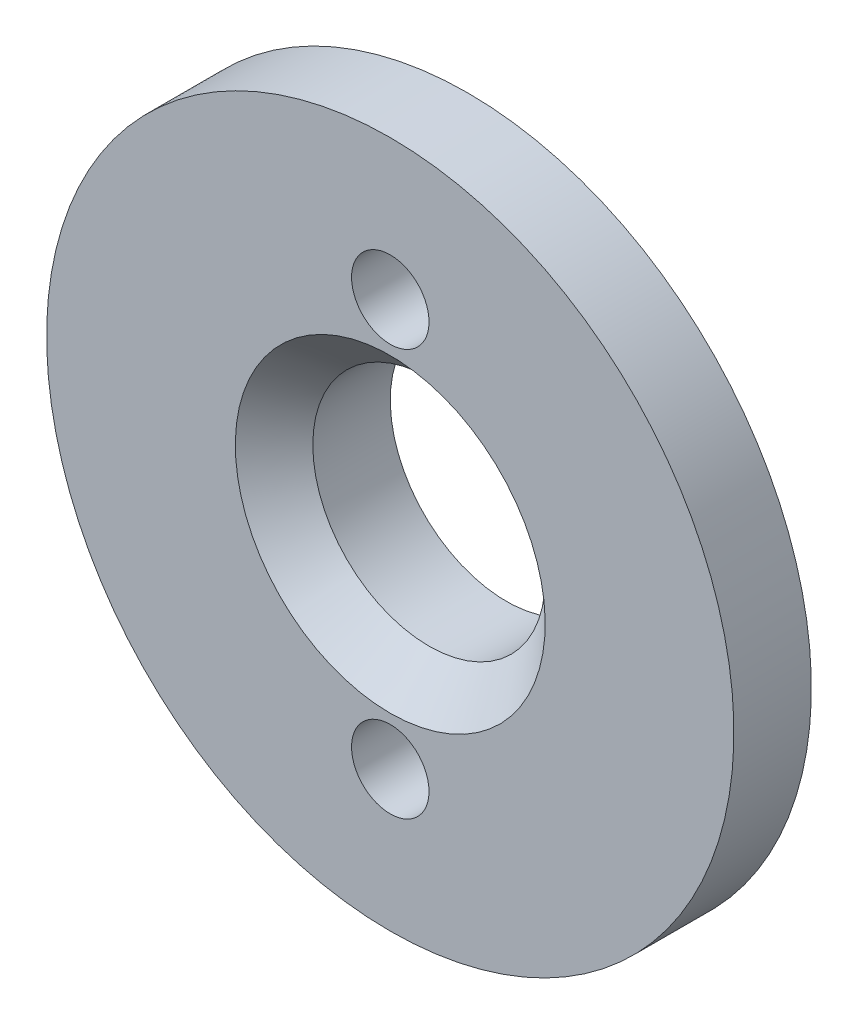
ISO-10303-21;
HEADER;
FILE_DESCRIPTION(('STEP AP214'),'2;1');
FILE_NAME('part.step','',(''),(''),'','','');
FILE_SCHEMA(('AUTOMOTIVE_DESIGN { 1 0 10303 214 1 1 1 1 }'));
ENDSEC;
DATA;
#1=APPLICATION_CONTEXT('core data for automotive mechanical design processes');
#2=APPLICATION_PROTOCOL_DEFINITION('international standard','automotive_design',2000,#1);
#3=PRODUCT_CONTEXT('',#1,'mechanical');
#4=PRODUCT('Part','Part','',(#3));
#5=PRODUCT_RELATED_PRODUCT_CATEGORY('part','',(#4));
#6=PRODUCT_DEFINITION_FORMATION('','',#4);
#7=PRODUCT_DEFINITION_CONTEXT('part definition',#1,'design');
#8=PRODUCT_DEFINITION('design','',#6,#7);
#9=PRODUCT_DEFINITION_SHAPE('','',#8);
#10=(LENGTH_UNIT() NAMED_UNIT(*) SI_UNIT(.MILLI.,.METRE.));
#11=(NAMED_UNIT(*) PLANE_ANGLE_UNIT() SI_UNIT($,.RADIAN.));
#12=(NAMED_UNIT(*) SI_UNIT($,.STERADIAN.) SOLID_ANGLE_UNIT());
#13=UNCERTAINTY_MEASURE_WITH_UNIT(LENGTH_MEASURE(1.E-05),#10,'distance_accuracy_value','');
#14=(GEOMETRIC_REPRESENTATION_CONTEXT(3) GLOBAL_UNCERTAINTY_ASSIGNED_CONTEXT((#13)) GLOBAL_UNIT_ASSIGNED_CONTEXT((#10,
#11,#12)) REPRESENTATION_CONTEXT('',''));
#15=CARTESIAN_POINT('',(0.,0.,0.));
#16=DIRECTION('',(0.,0.,1.));
#17=DIRECTION('',(1.,0.,0.));
#18=AXIS2_PLACEMENT_3D('',#15,#16,#17);
#19=CARTESIAN_POINT('',(0.,0.,2.38125));
#20=DIRECTION('',(0.,0.,1.));
#21=DIRECTION('',(0.,-1.,0.));
#22=AXIS2_PLACEMENT_3D('',#19,#20,#21);
#23=PLANE('',#22);
#24=CARTESIAN_POINT('',(0.,8.334375,2.38125));
#25=DIRECTION('',(0.,0.,1.));
#26=DIRECTION('',(0.,-1.,0.));
#27=AXIS2_PLACEMENT_3D('',#24,#25,#26);
#28=CIRCLE('',#27,1.5875);
#29=CARTESIAN_POINT('',(0.,6.746875,2.38125));
#30=VERTEX_POINT('',#29);
#31=EDGE_CURVE('E63',#30,#30,#28,.T.);
#32=ORIENTED_EDGE('',*,*,#31,.F.);
#33=EDGE_LOOP('',(#32));
#34=FACE_BOUND('',#33,.T.);
#35=CARTESIAN_POINT('',(0.,-8.334375,2.38125));
#36=DIRECTION('',(0.,0.,1.));
#37=DIRECTION('',(0.,-1.,0.));
#38=AXIS2_PLACEMENT_3D('',#35,#36,#37);
#39=CIRCLE('',#38,1.5875);
#40=CARTESIAN_POINT('',(0.,-9.921875,2.38125));
#41=VERTEX_POINT('',#40);
#42=EDGE_CURVE('E57',#41,#41,#39,.T.);
#43=ORIENTED_EDGE('',*,*,#42,.F.);
#44=EDGE_LOOP('',(#43));
#45=FACE_BOUND('',#44,.T.);
#46=CARTESIAN_POINT('',(0.,0.,2.38125));
#47=DIRECTION('',(0.,0.,1.));
#48=DIRECTION('',(0.,-1.,0.));
#49=AXIS2_PLACEMENT_3D('',#46,#47,#48);
#50=CIRCLE('',#49,6.35);
#51=CARTESIAN_POINT('',(0.,-6.35,2.38125));
#52=VERTEX_POINT('',#51);
#53=EDGE_CURVE('E35',#52,#52,#50,.F.);
#54=ORIENTED_EDGE('',*,*,#53,.T.);
#55=EDGE_LOOP('',(#54));
#56=FACE_BOUND('',#55,.T.);
#57=CARTESIAN_POINT('',(0.,0.,2.38125));
#58=DIRECTION('',(0.,0.,-1.));
#59=DIRECTION('',(0.,1.,0.));
#60=AXIS2_PLACEMENT_3D('',#57,#58,#59);
#61=CIRCLE('',#60,14.0843);
#62=CARTESIAN_POINT('',(0.,14.0843,2.38125));
#63=VERTEX_POINT('',#62);
#64=EDGE_CURVE('E39',#63,#63,#61,.T.);
#65=ORIENTED_EDGE('',*,*,#64,.F.);
#66=EDGE_LOOP('',(#65));
#67=FACE_BOUND('',#66,.T.);
#68=ADVANCED_FACE('F29',(#34,#45,#56,#67),#23,.T.);
#69=CARTESIAN_POINT('',(0.,0.,-36.4080944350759));
#70=DIRECTION('',(0.,0.,-1.));
#71=DIRECTION('',(0.,1.,0.));
#72=AXIS2_PLACEMENT_3D('',#69,#70,#71);
#73=CYLINDRICAL_SURFACE('',#72,14.0843);
#74=ORIENTED_EDGE('',*,*,#64,.T.);
#75=EDGE_LOOP('',(#74));
#76=FACE_BOUND('',#75,.T.);
#77=CARTESIAN_POINT('',(0.,0.,-0.793750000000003));
#78=DIRECTION('',(0.,0.,-1.));
#79=DIRECTION('',(0.,1.,0.));
#80=AXIS2_PLACEMENT_3D('',#77,#78,#79);
#81=CIRCLE('',#80,14.0843);
#82=CARTESIAN_POINT('',(0.,14.0843,-0.793750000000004));
#83=VERTEX_POINT('',#82);
#84=EDGE_CURVE('E43',#83,#83,#81,.T.);
#85=ORIENTED_EDGE('',*,*,#84,.F.);
#86=EDGE_LOOP('',(#85));
#87=FACE_BOUND('',#86,.T.);
#88=ADVANCED_FACE('F76',(#76,#87),#73,.T.);
#89=CARTESIAN_POINT('',(0.,14.0843,-0.793750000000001));
#90=DIRECTION('',(0.,0.,-1.));
#91=DIRECTION('',(0.,1.,0.));
#92=AXIS2_PLACEMENT_3D('',#89,#90,#91);
#93=PLANE('',#92);
#94=CARTESIAN_POINT('',(0.,8.334375,-0.793750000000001));
#95=DIRECTION('',(0.,0.,-1.));
#96=DIRECTION('',(0.,1.,0.));
#97=AXIS2_PLACEMENT_3D('',#94,#95,#96);
#98=CIRCLE('',#97,1.5875);
#99=CARTESIAN_POINT('',(0.,9.921875,-0.793750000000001));
#100=VERTEX_POINT('',#99);
#101=EDGE_CURVE('E66',#100,#100,#98,.T.);
#102=ORIENTED_EDGE('',*,*,#101,.F.);
#103=EDGE_LOOP('',(#102));
#104=FACE_BOUND('',#103,.T.);
#105=CARTESIAN_POINT('',(0.,-8.334375,-0.793749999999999));
#106=DIRECTION('',(0.,0.,-1.));
#107=DIRECTION('',(0.,1.,0.));
#108=AXIS2_PLACEMENT_3D('',#105,#106,#107);
#109=CIRCLE('',#108,1.5875);
#110=CARTESIAN_POINT('',(0.,-6.746875,-0.793749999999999));
#111=VERTEX_POINT('',#110);
#112=EDGE_CURVE('E60',#111,#111,#109,.T.);
#113=ORIENTED_EDGE('',*,*,#112,.F.);
#114=EDGE_LOOP('',(#113));
#115=FACE_BOUND('',#114,.T.);
#116=ORIENTED_EDGE('',*,*,#84,.T.);
#117=EDGE_LOOP('',(#116));
#118=FACE_BOUND('',#117,.T.);
#119=CARTESIAN_POINT('',(0.,0.,-0.793750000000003));
#120=DIRECTION('',(0.,0.,-1.));
#121=DIRECTION('',(0.,1.,0.));
#122=AXIS2_PLACEMENT_3D('',#119,#120,#121);
#123=CIRCLE('',#122,6.3246);
#124=CARTESIAN_POINT('',(0.,6.32459999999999,-0.793750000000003));
#125=VERTEX_POINT('',#124);
#126=EDGE_CURVE('E48',#125,#125,#123,.T.);
#127=ORIENTED_EDGE('',*,*,#126,.F.);
#128=EDGE_LOOP('',(#127));
#129=FACE_BOUND('',#128,.T.);
#130=ADVANCED_FACE('F72',(#104,#115,#118,#129),#93,.T.);
#131=CARTESIAN_POINT('',(0.,0.,-36.4080944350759));
#132=DIRECTION('',(0.,0.,-1.));
#133=DIRECTION('',(0.,1.,0.));
#134=AXIS2_PLACEMENT_3D('',#131,#132,#133);
#135=CYLINDRICAL_SURFACE('',#134,6.3246);
#136=ORIENTED_EDGE('',*,*,#126,.T.);
#137=EDGE_LOOP('',(#136));
#138=FACE_BOUND('',#137,.T.);
#139=CARTESIAN_POINT('',(0.,0.,-2.38125));
#140=DIRECTION('',(0.,0.,-1.));
#141=DIRECTION('',(0.,1.,0.));
#142=AXIS2_PLACEMENT_3D('',#139,#140,#141);
#143=CIRCLE('',#142,6.3246);
#144=CARTESIAN_POINT('',(0.,6.32459999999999,-2.38125));
#145=VERTEX_POINT('',#144);
#146=EDGE_CURVE('E51',#145,#145,#143,.T.);
#147=ORIENTED_EDGE('',*,*,#146,.F.);
#148=EDGE_LOOP('',(#147));
#149=FACE_BOUND('',#148,.T.);
#150=ADVANCED_FACE('F75',(#138,#149),#135,.T.);
#151=CARTESIAN_POINT('',(0.,6.32459999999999,-2.38125));
#152=DIRECTION('',(0.,0.,-1.));
#153=DIRECTION('',(0.,1.,0.));
#154=AXIS2_PLACEMENT_3D('',#151,#152,#153);
#155=PLANE('',#154);
#156=CARTESIAN_POINT('',(0.,0.,-2.38125));
#157=DIRECTION('',(0.,0.,-1.));
#158=DIRECTION('',(0.,1.,0.));
#159=AXIS2_PLACEMENT_3D('',#156,#157,#158);
#160=CIRCLE('',#159,4.76249999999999);
#161=CARTESIAN_POINT('',(0.,4.76249999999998,-2.38125));
#162=VERTEX_POINT('',#161);
#163=EDGE_CURVE('E54',#162,#162,#160,.T.);
#164=ORIENTED_EDGE('',*,*,#163,.F.);
#165=EDGE_LOOP('',(#164));
#166=FACE_BOUND('',#165,.T.);
#167=ORIENTED_EDGE('',*,*,#146,.T.);
#168=EDGE_LOOP('',(#167));
#169=FACE_BOUND('',#168,.T.);
#170=ADVANCED_FACE('F86',(#166,#169),#155,.T.);
#171=CARTESIAN_POINT('',(0.,0.,-2.38125));
#172=DIRECTION('',(0.,0.,-1.));
#173=DIRECTION('',(0.,1.,0.));
#174=AXIS2_PLACEMENT_3D('',#171,#172,#173);
#175=CYLINDRICAL_SURFACE('',#174,4.76249999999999);
#176=CARTESIAN_POINT('',(0.,0.,0.793749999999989));
#177=DIRECTION('',(0.,0.,1.));
#178=DIRECTION('',(0.,-1.,0.));
#179=AXIS2_PLACEMENT_3D('',#176,#177,#178);
#180=CIRCLE('',#179,4.76249999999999);
#181=CARTESIAN_POINT('',(0.,-4.7625,0.79374999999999));
#182=VERTEX_POINT('',#181);
#183=EDGE_CURVE('E10',#182,#182,#180,.T.);
#184=ORIENTED_EDGE('',*,*,#183,.T.);
#185=EDGE_LOOP('',(#184));
#186=FACE_BOUND('',#185,.T.);
#187=ORIENTED_EDGE('',*,*,#163,.T.);
#188=EDGE_LOOP('',(#187));
#189=FACE_BOUND('',#188,.T.);
#190=ADVANCED_FACE('F91',(#186,#189),#175,.F.);
#191=CARTESIAN_POINT('',(0.,0.,2.38125));
#192=DIRECTION('',(0.,0.,1.));
#193=DIRECTION('',(0.,-1.,0.));
#194=AXIS2_PLACEMENT_3D('',#191,#192,#193);
#195=CONICAL_SURFACE('',#194,6.35,0.785398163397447);
#196=ORIENTED_EDGE('',*,*,#183,.F.);
#197=EDGE_LOOP('',(#196));
#198=FACE_BOUND('',#197,.T.);
#199=ORIENTED_EDGE('',*,*,#53,.F.);
#200=EDGE_LOOP('',(#199));
#201=FACE_BOUND('',#200,.T.);
#202=ADVANCED_FACE('F97',(#198,#201),#195,.F.);
#203=CARTESIAN_POINT('',(0.,-8.334375,-0.793749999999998));
#204=DIRECTION('',(0.,0.,-1.));
#205=DIRECTION('',(0.,1.,0.));
#206=AXIS2_PLACEMENT_3D('',#203,#204,#205);
#207=CYLINDRICAL_SURFACE('',#206,1.5875);
#208=ORIENTED_EDGE('',*,*,#42,.T.);
#209=EDGE_LOOP('',(#208));
#210=FACE_BOUND('',#209,.T.);
#211=ORIENTED_EDGE('',*,*,#112,.T.);
#212=EDGE_LOOP('',(#211));
#213=FACE_BOUND('',#212,.T.);
#214=ADVANCED_FACE('F113',(#210,#213),#207,.F.);
#215=CARTESIAN_POINT('',(0.,8.334375,-0.79375));
#216=DIRECTION('',(0.,0.,-1.));
#217=DIRECTION('',(0.,1.,0.));
#218=AXIS2_PLACEMENT_3D('',#215,#216,#217);
#219=CYLINDRICAL_SURFACE('',#218,1.5875);
#220=ORIENTED_EDGE('',*,*,#31,.T.);
#221=EDGE_LOOP('',(#220));
#222=FACE_BOUND('',#221,.T.);
#223=ORIENTED_EDGE('',*,*,#101,.T.);
#224=EDGE_LOOP('',(#223));
#225=FACE_BOUND('',#224,.T.);
#226=ADVANCED_FACE('F70',(#222,#225),#219,.F.);
#227=CLOSED_SHELL('',(#68,#88,#130,#150,#170,#190,#202,#214,#226));
#228=MANIFOLD_SOLID_BREP('B2',#227);
#229=ADVANCED_BREP_SHAPE_REPRESENTATION('',(#18,#228),#14);
#230=SHAPE_DEFINITION_REPRESENTATION(#9,#229);
ENDSEC;
END-ISO-10303-21;
